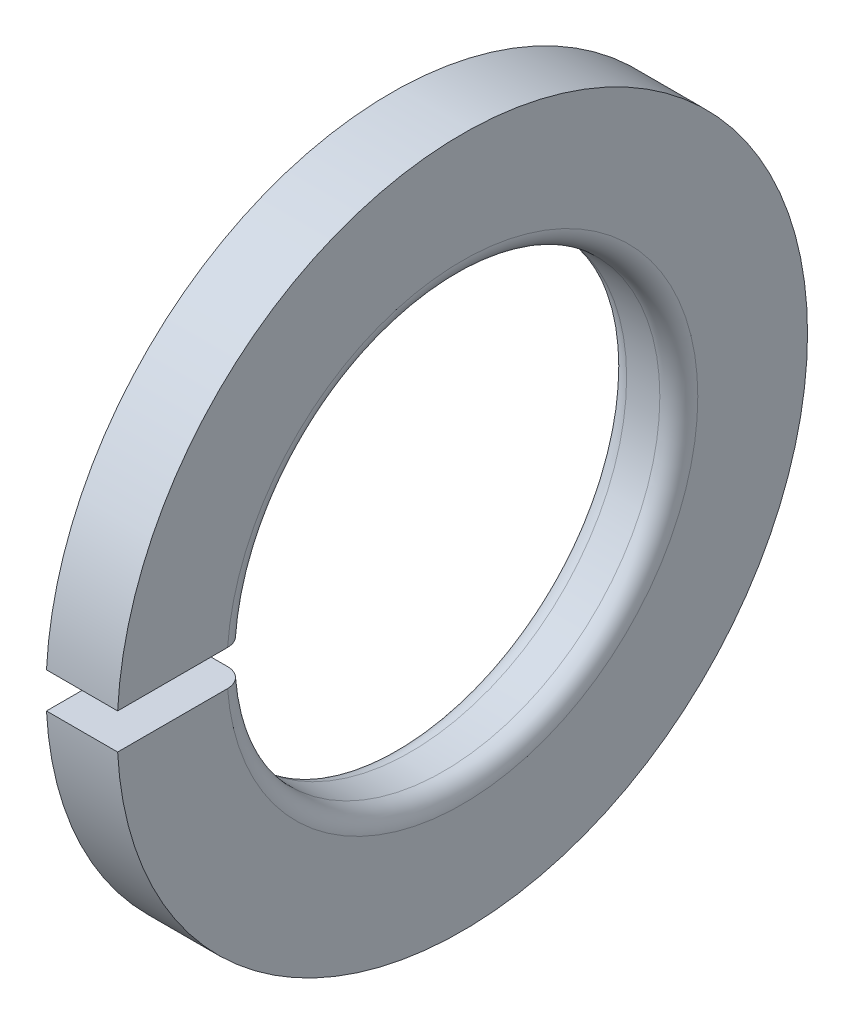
ISO-10303-21;
HEADER;
FILE_DESCRIPTION(('STEP AP214'),'2;1');
FILE_NAME('part.step','',(''),(''),'','','');
FILE_SCHEMA(('AUTOMOTIVE_DESIGN { 1 0 10303 214 1 1 1 1 }'));
ENDSEC;
DATA;
#1=APPLICATION_CONTEXT('core data for automotive mechanical design processes');
#2=APPLICATION_PROTOCOL_DEFINITION('international standard','automotive_design',2000,#1);
#3=PRODUCT_CONTEXT('',#1,'mechanical');
#4=PRODUCT('Part','Part','',(#3));
#5=PRODUCT_RELATED_PRODUCT_CATEGORY('part','',(#4));
#6=PRODUCT_DEFINITION_FORMATION('','',#4);
#7=PRODUCT_DEFINITION_CONTEXT('part definition',#1,'design');
#8=PRODUCT_DEFINITION('design','',#6,#7);
#9=PRODUCT_DEFINITION_SHAPE('','',#8);
#10=(LENGTH_UNIT() NAMED_UNIT(*) SI_UNIT(.MILLI.,.METRE.));
#11=(NAMED_UNIT(*) PLANE_ANGLE_UNIT() SI_UNIT($,.RADIAN.));
#12=(NAMED_UNIT(*) SI_UNIT($,.STERADIAN.) SOLID_ANGLE_UNIT());
#13=UNCERTAINTY_MEASURE_WITH_UNIT(LENGTH_MEASURE(1.E-05),#10,'distance_accuracy_value','');
#14=(GEOMETRIC_REPRESENTATION_CONTEXT(3) GLOBAL_UNCERTAINTY_ASSIGNED_CONTEXT((#13)) GLOBAL_UNIT_ASSIGNED_CONTEXT((#10,
#11,#12)) REPRESENTATION_CONTEXT('',''));
#15=CARTESIAN_POINT('',(0.,0.,0.));
#16=DIRECTION('',(0.,0.,1.));
#17=DIRECTION('',(1.,0.,0.));
#18=AXIS2_PLACEMENT_3D('',#15,#16,#17);
#19=CARTESIAN_POINT('',(-34.9249999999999,0.,0.));
#20=DIRECTION('',(-1.,0.,0.));
#21=DIRECTION('',(0.,0.,1.));
#22=AXIS2_PLACEMENT_3D('',#19,#20,#21);
#23=CYLINDRICAL_SURFACE('',#22,29.1);
#24=DIRECTION('',(-1.,0.,0.));
#25=VECTOR('',#24,1.);
#26=CARTESIAN_POINT('',(-34.9249999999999,1.5,29.0613144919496));
#27=LINE('',#26,#25);
#28=CARTESIAN_POINT('',(0.,1.5,29.0613144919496));
#29=VERTEX_POINT('',#28);
#30=CARTESIAN_POINT('',(-6.,1.5,29.0613144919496));
#31=VERTEX_POINT('',#30);
#32=EDGE_CURVE('E46',#29,#31,#27,.T.);
#33=ORIENTED_EDGE('',*,*,#32,.F.);
#34=CARTESIAN_POINT('',(0.,0.,0.));
#35=DIRECTION('',(-1.,0.,0.));
#36=DIRECTION('',(0.,0.,1.));
#37=AXIS2_PLACEMENT_3D('',#34,#35,#36);
#38=CIRCLE('',#37,29.1);
#39=CARTESIAN_POINT('',(0.,-1.5,29.0613144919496));
#40=VERTEX_POINT('',#39);
#41=EDGE_CURVE('E107',#29,#40,#38,.T.);
#42=ORIENTED_EDGE('',*,*,#41,.T.);
#43=DIRECTION('',(-1.,0.,0.));
#44=VECTOR('',#43,1.);
#45=CARTESIAN_POINT('',(-34.9249999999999,-1.5,29.0613144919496));
#46=LINE('',#45,#44);
#47=CARTESIAN_POINT('',(-6.,-1.5,29.0613144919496));
#48=VERTEX_POINT('',#47);
#49=EDGE_CURVE('E88',#48,#40,#46,.F.);
#50=ORIENTED_EDGE('',*,*,#49,.F.);
#51=CARTESIAN_POINT('',(-6.,0.,0.));
#52=DIRECTION('',(-1.,0.,0.));
#53=DIRECTION('',(0.,0.,1.));
#54=AXIS2_PLACEMENT_3D('',#51,#52,#53);
#55=CIRCLE('',#54,29.1);
#56=EDGE_CURVE('E119',#31,#48,#55,.T.);
#57=ORIENTED_EDGE('',*,*,#56,.F.);
#58=EDGE_LOOP('',(#33,#42,#50,#57));
#59=FACE_BOUND('',#58,.T.);
#60=ADVANCED_FACE('F33',(#59),#23,.T.);
#61=CARTESIAN_POINT('',(0.,19.85,0.));
#62=DIRECTION('',(-1.,0.,0.));
#63=DIRECTION('',(0.,0.,1.));
#64=AXIS2_PLACEMENT_3D('',#61,#62,#63);
#65=PLANE('',#64);
#66=DIRECTION('',(0.,0.,-1.));
#67=VECTOR('',#66,1.);
#68=CARTESIAN_POINT('',(0.,1.5,29.682));
#69=LINE('',#68,#67);
#70=CARTESIAN_POINT('',(0.,1.5,19.7932437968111));
#71=VERTEX_POINT('',#70);
#72=EDGE_CURVE('E93',#29,#71,#69,.T.);
#73=ORIENTED_EDGE('',*,*,#72,.T.);
#74=CARTESIAN_POINT('',(0.,0.,0.));
#75=DIRECTION('',(-1.,0.,0.));
#76=DIRECTION('',(0.,0.,1.));
#77=AXIS2_PLACEMENT_3D('',#74,#75,#76);
#78=CIRCLE('',#77,19.85);
#79=CARTESIAN_POINT('',(0.,-1.5,19.7932437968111));
#80=VERTEX_POINT('',#79);
#81=EDGE_CURVE('E100',#71,#80,#78,.T.);
#82=ORIENTED_EDGE('',*,*,#81,.T.);
#83=DIRECTION('',(0.,0.,1.));
#84=VECTOR('',#83,1.);
#85=CARTESIAN_POINT('',(0.,-1.5,0.));
#86=LINE('',#85,#84);
#87=EDGE_CURVE('E82',#80,#40,#86,.T.);
#88=ORIENTED_EDGE('',*,*,#87,.T.);
#89=ORIENTED_EDGE('',*,*,#41,.F.);
#90=EDGE_LOOP('',(#73,#82,#88,#89));
#91=FACE_BOUND('',#90,.T.);
#92=ADVANCED_FACE('F106',(#91),#65,.F.);
#93=CARTESIAN_POINT('',(-1.6,0.,0.));
#94=DIRECTION('',(-1.,0.,0.));
#95=DIRECTION('',(0.,0.,1.));
#96=AXIS2_PLACEMENT_3D('',#93,#94,#95);
#97=TOROIDAL_SURFACE('',#96,19.85,1.6);
#98=ORIENTED_EDGE('',*,*,#81,.F.);
#99=CARTESIAN_POINT('',(-1.25298037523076,1.5,18.2264660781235));
#100=CARTESIAN_POINT('',(-1.34042814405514,1.5,18.2069757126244));
#101=CARTESIAN_POINT('',(-1.42958478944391,1.5,18.1948546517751));
#102=CARTESIAN_POINT('',(-1.60874073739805,1.5,18.1857493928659));
#103=CARTESIAN_POINT('',(-1.69874091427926,1.5,18.1887831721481));
#104=CARTESIAN_POINT('',(-1.87691688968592,1.5,18.2099216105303));
#105=CARTESIAN_POINT('',(-1.96509356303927,1.5,18.2280188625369));
#106=CARTESIAN_POINT('',(-2.13713566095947,1.5,18.2787474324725));
#107=CARTESIAN_POINT('',(-2.22100211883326,1.5,18.3113752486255));
#108=CARTESIAN_POINT('',(-2.38213934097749,1.5,18.3902501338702));
#109=CARTESIAN_POINT('',(-2.45940535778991,1.5,18.4365069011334));
#110=CARTESIAN_POINT('',(-2.605104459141,1.5,18.5413052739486));
#111=CARTESIAN_POINT('',(-2.67353710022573,1.5,18.5998474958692));
#112=CARTESIAN_POINT('',(-2.7998187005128,1.5,18.727714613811));
#113=CARTESIAN_POINT('',(-2.85763944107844,1.5,18.7970673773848));
#114=CARTESIAN_POINT('',(-2.96086027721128,1.5,18.9444701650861));
#115=CARTESIAN_POINT('',(-3.0062601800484,1.5,19.0225203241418));
#116=CARTESIAN_POINT('',(-3.08349717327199,1.5,19.1853648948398));
#117=CARTESIAN_POINT('',(-3.11529145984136,1.5,19.270179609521));
#118=CARTESIAN_POINT('',(-3.16422330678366,1.5,19.4439365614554));
#119=CARTESIAN_POINT('',(-3.18136069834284,1.5,19.5328788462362));
#120=CARTESIAN_POINT('',(-3.2005191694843,1.5,19.7125655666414));
#121=CARTESIAN_POINT('',(-3.2025085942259,1.5,19.8033133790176));
#122=CARTESIAN_POINT('',(-3.19122833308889,1.5,19.9838562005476));
#123=CARTESIAN_POINT('',(-3.17795857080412,1.5,20.0736512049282));
#124=CARTESIAN_POINT('',(-3.13652216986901,1.5,20.2497586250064));
#125=CARTESIAN_POINT('',(-3.10835205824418,1.5,20.3360702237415));
#126=CARTESIAN_POINT('',(-3.03789973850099,1.5,20.5027282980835));
#127=CARTESIAN_POINT('',(-2.9956176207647,1.5,20.5830748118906));
#128=CARTESIAN_POINT('',(-2.89820398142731,1.5,20.7353886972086));
#129=CARTESIAN_POINT('',(-2.84309191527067,1.5,20.8073685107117));
#130=CARTESIAN_POINT('',(-2.72153836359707,1.5,20.9410252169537));
#131=CARTESIAN_POINT('',(-2.65509701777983,1.5,21.0027022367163));
#132=CARTESIAN_POINT('',(-2.51294485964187,1.5,21.1138406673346));
#133=CARTESIAN_POINT('',(-2.43725717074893,1.5,21.1633316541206));
#134=CARTESIAN_POINT('',(-2.27863173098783,1.5,21.2488689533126));
#135=CARTESIAN_POINT('',(-2.19569407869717,1.5,21.2849154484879));
#136=CARTESIAN_POINT('',(-2.02513478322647,1.5,21.3424543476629));
#137=CARTESIAN_POINT('',(-1.93752471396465,1.5,21.3639810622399));
#138=CARTESIAN_POINT('',(-1.7599325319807,1.5,21.391997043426));
#139=CARTESIAN_POINT('',(-1.6699504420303,1.5,21.3984864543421));
#140=CARTESIAN_POINT('',(-1.4903051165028,1.5,21.3962424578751));
#141=CARTESIAN_POINT('',(-1.40064160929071,1.5,21.3875307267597));
#142=CARTESIAN_POINT('',(-1.22405040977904,1.5,21.3551772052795));
#143=CARTESIAN_POINT('',(-1.13712271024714,1.5,21.3315354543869));
#144=CARTESIAN_POINT('',(-0.96846738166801,1.5,21.2700014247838));
#145=CARTESIAN_POINT('',(-0.886739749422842,1.5,21.2321091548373));
#146=CARTESIAN_POINT('',(-0.730793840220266,1.5,21.1431601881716));
#147=CARTESIAN_POINT('',(-0.656575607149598,1.5,21.0921034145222));
#148=CARTESIAN_POINT('',(-0.517638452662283,1.5,20.9782021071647));
#149=CARTESIAN_POINT('',(-0.452933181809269,1.5,20.915340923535));
#150=CARTESIAN_POINT('',(-0.334964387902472,1.5,20.77967039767));
#151=CARTESIAN_POINT('',(-0.281700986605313,1.5,20.7068609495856));
#152=CARTESIAN_POINT('',(-0.187992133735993,1.5,20.5531775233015));
#153=CARTESIAN_POINT('',(-0.147577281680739,1.5,20.4722848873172));
#154=CARTESIAN_POINT('',(-0.0808638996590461,1.5,20.3048742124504));
#155=CARTESIAN_POINT('',(-0.0545655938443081,1.5,20.2183560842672));
#156=CARTESIAN_POINT('',(-0.0167679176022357,1.5,20.0419232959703));
#157=CARTESIAN_POINT('',(-0.00530496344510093,1.5,19.9520008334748));
#158=CARTESIAN_POINT('',(0.00238683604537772,1.5,19.771506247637));
#159=CARTESIAN_POINT('',(-0.00138451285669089,1.5,19.6809341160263));
#160=CARTESIAN_POINT('',(-0.0240707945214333,1.5,19.5015639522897));
#161=CARTESIAN_POINT('',(-0.0430090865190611,1.5,19.4127688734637));
#162=CARTESIAN_POINT('',(-0.095526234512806,1.5,19.2396222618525));
#163=CARTESIAN_POINT('',(-0.129104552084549,1.5,19.1552705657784));
#164=CARTESIAN_POINT('',(-0.209946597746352,1.5,18.9934345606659));
#165=CARTESIAN_POINT('',(-0.25720606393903,1.5,18.9159481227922));
#166=CARTESIAN_POINT('',(-0.364102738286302,1.5,18.7700102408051));
#167=CARTESIAN_POINT('',(-0.423742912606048,1.5,18.7015609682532));
#168=CARTESIAN_POINT('',(-0.553593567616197,1.5,18.5757948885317));
#169=CARTESIAN_POINT('',(-0.623787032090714,1.5,18.5184604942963));
#170=CARTESIAN_POINT('',(-0.772776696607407,1.5,18.4164937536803));
#171=CARTESIAN_POINT('',(-0.851562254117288,1.5,18.371845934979));
#172=CARTESIAN_POINT('',(-0.984650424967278,1.5,18.3106507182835));
#173=CARTESIAN_POINT('',(-1.03704006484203,1.5,18.2898465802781));
#174=CARTESIAN_POINT('',(-1.14372153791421,1.5,18.2538797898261));
#175=CARTESIAN_POINT('',(-1.19801336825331,1.5,18.2387171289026));
#176=CARTESIAN_POINT('',(-1.25298037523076,1.5,18.2264660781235));
#177=B_SPLINE_CURVE_WITH_KNOTS('',3,(#99,#100,#101,#102,#103,#104,#105,#106,#107,#108,#109,#110,
#111,#112,#113,#114,#115,#116,#117,#118,#119,#120,#121,#122,#123,#124,#125,#126,#127,#128,#129,
#130,#131,#132,#133,#134,#135,#136,#137,#138,#139,#140,#141,#142,#143,#144,#145,#146,#147,#148,
#149,#150,#151,#152,#153,#154,#155,#156,#157,#158,#159,#160,#161,#162,#163,#164,#165,#166,#167,
#168,#169,#170,#171,#172,#173,#174,#175,#176),.UNSPECIFIED.,.T.,.F.,(4,2,2,2,2,2,2,2,2,2,2,2,2,
2,2,2,2,2,2,2,2,2,2,2,2,2,2,2,2,2,2,2,2,2,2,2,2,2,4),(0.,0.268574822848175,0.537468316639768,
0.806229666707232,1.07492628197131,1.34381456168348,1.61271633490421,1.88232311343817,
2.15193407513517,2.42238711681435,2.69284327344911,2.96386445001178,3.23488698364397,
3.50597271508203,3.77705671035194,4.04773227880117,4.31840450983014,4.58841318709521,
4.85841819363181,5.12778291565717,5.39714505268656,5.6661234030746,5.93510104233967,
6.20407851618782,6.47305756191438,6.74241888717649,7.01178307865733,7.28178405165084,
7.55178931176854,7.8224561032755,8.09312634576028,8.36421426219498,8.63529220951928,
8.90628580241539,9.17734439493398,9.4479705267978,9.71826517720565,9.88708339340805,
10.0559013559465),.UNSPECIFIED.);
#178=CARTESIAN_POINT('',(-1.60000000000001,1.5,18.1882517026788));
#179=VERTEX_POINT('',#178);
#180=EDGE_CURVE('E126',#71,#179,#177,.T.);
#181=ORIENTED_EDGE('',*,*,#180,.T.);
#182=CARTESIAN_POINT('',(-1.60000000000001,0.,0.));
#183=DIRECTION('',(-1.,0.,0.));
#184=DIRECTION('',(0.,0.,1.));
#185=AXIS2_PLACEMENT_3D('',#182,#183,#184);
#186=CIRCLE('',#185,18.25);
#187=CARTESIAN_POINT('',(-1.60000000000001,-1.5,18.1882517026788));
#188=VERTEX_POINT('',#187);
#189=EDGE_CURVE('E102',#179,#188,#186,.T.);
#190=ORIENTED_EDGE('',*,*,#189,.T.);
#191=CARTESIAN_POINT('',(-1.25298037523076,-1.5,18.2264660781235));
#192=CARTESIAN_POINT('',(-1.16534855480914,-1.5,18.2460057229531));
#193=CARTESIAN_POINT('',(-1.07930546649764,-1.5,18.2729745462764));
#194=CARTESIAN_POINT('',(-0.912903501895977,-1.5,18.3410113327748));
#195=CARTESIAN_POINT('',(-0.832551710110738,-1.5,18.3820965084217));
#196=CARTESIAN_POINT('',(-0.679924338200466,-1.5,18.4771473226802));
#197=CARTESIAN_POINT('',(-0.60764396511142,-1.5,18.5311052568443));
#198=CARTESIAN_POINT('',(-0.473163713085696,-1.5,18.65035078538));
#199=CARTESIAN_POINT('',(-0.410961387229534,-1.5,18.7156356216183));
#200=CARTESIAN_POINT('',(-0.29822041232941,-1.5,18.8558467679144));
#201=CARTESIAN_POINT('',(-0.247708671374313,-1.5,18.9307947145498));
#202=CARTESIAN_POINT('',(-0.159939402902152,-1.5,19.0880901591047));
#203=CARTESIAN_POINT('',(-0.122682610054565,-1.5,19.1704380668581));
#204=CARTESIAN_POINT('',(-0.0623741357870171,-1.5,19.3404534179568));
#205=CARTESIAN_POINT('',(-0.0393644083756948,-1.5,19.4281357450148));
#206=CARTESIAN_POINT('',(-0.00836619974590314,-1.5,19.6061167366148));
#207=CARTESIAN_POINT('',(-0.000377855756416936,-1.5,19.696415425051));
#208=CARTESIAN_POINT('',(0.000352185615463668,-1.5,19.8772171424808));
#209=CARTESIAN_POINT('',(-0.00693009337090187,-1.5,19.9677202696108));
#210=CARTESIAN_POINT('',(-0.0365903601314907,-1.5,20.1462185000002));
#211=CARTESIAN_POINT('',(-0.0589683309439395,-1.5,20.2342136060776));
#212=CARTESIAN_POINT('',(-0.11818624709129,-1.5,20.4051618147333));
#213=CARTESIAN_POINT('',(-0.155021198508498,-1.5,20.4881166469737));
#214=CARTESIAN_POINT('',(-0.242120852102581,-1.5,20.6466485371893));
#215=CARTESIAN_POINT('',(-0.292385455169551,-1.5,20.7222256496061));
#216=CARTESIAN_POINT('',(-0.404819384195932,-1.5,20.8637001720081));
#217=CARTESIAN_POINT('',(-0.466965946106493,-1.5,20.9296156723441));
#218=CARTESIAN_POINT('',(-0.601468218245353,-1.5,21.0500449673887));
#219=CARTESIAN_POINT('',(-0.673823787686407,-1.5,21.1045589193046));
#220=CARTESIAN_POINT('',(-0.826493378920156,-1.5,21.2004914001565));
#221=CARTESIAN_POINT('',(-0.906786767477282,-1.5,21.2419427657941));
#222=CARTESIAN_POINT('',(-1.0732037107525,-1.5,21.3107434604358));
#223=CARTESIAN_POINT('',(-1.15932719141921,-1.5,21.3380929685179));
#224=CARTESIAN_POINT('',(-1.33475936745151,-1.5,21.3778570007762));
#225=CARTESIAN_POINT('',(-1.4240607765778,-1.5,21.3903036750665));
#226=CARTESIAN_POINT('',(-1.60348491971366,-1.5,21.4000109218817));
#227=CARTESIAN_POINT('',(-1.69360764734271,-1.5,21.3972716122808));
#228=CARTESIAN_POINT('',(-1.87201905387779,-1.5,21.3766967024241));
#229=CARTESIAN_POINT('',(-1.96030951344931,-1.5,21.3588765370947));
#230=CARTESIAN_POINT('',(-2.13264747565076,-1.5,21.3086728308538));
#231=CARTESIAN_POINT('',(-2.21669497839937,-1.5,21.2762892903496));
#232=CARTESIAN_POINT('',(-2.37820588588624,-1.5,21.1978699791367));
#233=CARTESIAN_POINT('',(-2.45566628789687,-1.5,21.1518280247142));
#234=CARTESIAN_POINT('',(-2.60177564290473,-1.5,21.0474148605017));
#235=CARTESIAN_POINT('',(-2.67042452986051,-1.5,20.9890435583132));
#236=CARTESIAN_POINT('',(-2.79709621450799,-1.5,20.8615213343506));
#237=CARTESIAN_POINT('',(-2.85509990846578,-1.5,20.7923514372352));
#238=CARTESIAN_POINT('',(-2.95870573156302,-1.5,20.6452759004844));
#239=CARTESIAN_POINT('',(-3.00430769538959,-1.5,20.567370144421));
#240=CARTESIAN_POINT('',(-3.08193659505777,-1.5,20.404826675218));
#241=CARTESIAN_POINT('',(-3.113929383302,-1.5,20.3201726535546));
#242=CARTESIAN_POINT('',(-3.16328501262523,-1.5,20.1467022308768));
#243=CARTESIAN_POINT('',(-3.18064766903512,-1.5,20.0578857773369));
#244=CARTESIAN_POINT('',(-3.20028572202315,-1.5,19.8783951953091));
#245=CARTESIAN_POINT('',(-3.20252668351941,-1.5,19.7877172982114));
#246=CARTESIAN_POINT('',(-3.19177100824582,-1.5,19.6072691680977));
#247=CARTESIAN_POINT('',(-3.17877420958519,-1.5,19.5174989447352));
#248=CARTESIAN_POINT('',(-3.13788622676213,-1.5,19.3413158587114));
#249=CARTESIAN_POINT('',(-3.10997925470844,-1.5,19.2549066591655));
#250=CARTESIAN_POINT('',(-3.04004343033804,-1.5,19.0880047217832));
#251=CARTESIAN_POINT('',(-2.99801456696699,-1.5,19.0075119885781));
#252=CARTESIAN_POINT('',(-2.90105362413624,-1.5,18.854801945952));
#253=CARTESIAN_POINT('',(-2.8461316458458,-1.5,18.7825782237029));
#254=CARTESIAN_POINT('',(-2.7249157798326,-1.5,18.6484085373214));
#255=CARTESIAN_POINT('',(-2.65862247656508,-1.5,18.586462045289));
#256=CARTESIAN_POINT('',(-2.51672811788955,-1.5,18.474779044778));
#257=CARTESIAN_POINT('',(-2.44115198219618,-1.5,18.4250108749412));
#258=CARTESIAN_POINT('',(-2.28267459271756,-1.5,18.3389039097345));
#259=CARTESIAN_POINT('',(-2.19977164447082,-1.5,18.3025682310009));
#260=CARTESIAN_POINT('',(-2.02926265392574,-1.5,18.2444784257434));
#261=CARTESIAN_POINT('',(-1.94166980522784,-1.5,18.2226854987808));
#262=CARTESIAN_POINT('',(-1.76413858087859,-1.5,18.1941825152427));
#263=CARTESIAN_POINT('',(-1.67420321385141,-1.5,18.1874539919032));
#264=CARTESIAN_POINT('',(-1.52868981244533,-1.5,18.1888702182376));
#265=CARTESIAN_POINT('',(-1.47302530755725,-1.5,18.1923397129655));
#266=CARTESIAN_POINT('',(-1.3623633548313,-1.5,18.205074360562));
#267=CARTESIAN_POINT('',(-1.30736590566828,-1.5,18.2143395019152));
#268=CARTESIAN_POINT('',(-1.25298037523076,-1.5,18.2264660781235));
#269=B_SPLINE_CURVE_WITH_KNOTS('',3,(#191,#192,#193,#194,#195,#196,#197,#198,#199,#200,#201,
#202,#203,#204,#205,#206,#207,#208,#209,#210,#211,#212,#213,#214,#215,#216,#217,#218,#219,#220,
#221,#222,#223,#224,#225,#226,#227,#228,#229,#230,#231,#232,#233,#234,#235,#236,#237,#238,#239,
#240,#241,#242,#243,#244,#245,#246,#247,#248,#249,#250,#251,#252,#253,#254,#255,#256,#257,#258,
#259,#260,#261,#262,#263,#264,#265,#266,#267,#268),.UNSPECIFIED.,.T.,.F.,(4,2,2,2,2,2,2,2,2,2,2,
2,2,2,2,2,2,2,2,2,2,2,2,2,2,2,2,2,2,2,2,2,2,2,2,2,2,2,4),(0.,0.269147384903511,
0.538624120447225,0.807939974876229,1.07719034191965,1.34705440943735,1.61693343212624,
1.88760344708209,2.1582759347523,2.42937372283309,2.70047120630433,2.97147512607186,
3.24247704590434,3.51296487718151,3.78344897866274,4.05324761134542,4.32304281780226,
4.59225493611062,4.86146496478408,5.13039979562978,5.39933461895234,5.66839138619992,
5.93745016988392,6.20698717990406,6.47652778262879,6.74674077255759,7.01695717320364,
7.28778870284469,7.55862310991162,7.829744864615,8.10086683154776,8.37177709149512,
8.64267343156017,8.91285782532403,9.18310486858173,9.45262797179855,9.72182049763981,
9.88885745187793,10.0558940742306),.UNSPECIFIED.);
#270=EDGE_CURVE('E85',#188,#80,#269,.T.);
#271=ORIENTED_EDGE('',*,*,#270,.T.);
#272=EDGE_LOOP('',(#98,#181,#190,#271));
#273=FACE_BOUND('',#272,.T.);
#274=ADVANCED_FACE('F98',(#273),#97,.T.);
#275=CARTESIAN_POINT('',(-34.9249999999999,0.,0.));
#276=DIRECTION('',(-1.,0.,0.));
#277=DIRECTION('',(0.,0.,1.));
#278=AXIS2_PLACEMENT_3D('',#275,#276,#277);
#279=CYLINDRICAL_SURFACE('',#278,18.25);
#280=DIRECTION('',(-1.,0.,0.));
#281=VECTOR('',#280,1.);
#282=CARTESIAN_POINT('',(-34.9249999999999,1.5,18.1882517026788));
#283=LINE('',#282,#281);
#284=CARTESIAN_POINT('',(-4.39999999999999,1.5,18.1882517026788));
#285=VERTEX_POINT('',#284);
#286=EDGE_CURVE('E134',#285,#179,#283,.F.);
#287=ORIENTED_EDGE('',*,*,#286,.F.);
#288=CARTESIAN_POINT('',(-4.39999999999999,0.,0.));
#289=DIRECTION('',(-1.,0.,0.));
#290=DIRECTION('',(0.,0.,1.));
#291=AXIS2_PLACEMENT_3D('',#288,#289,#290);
#292=CIRCLE('',#291,18.25);
#293=CARTESIAN_POINT('',(-4.3999999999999,-1.5,18.1882517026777));
#294=VERTEX_POINT('',#293);
#295=EDGE_CURVE('E110',#285,#294,#292,.T.);
#296=ORIENTED_EDGE('',*,*,#295,.T.);
#297=DIRECTION('',(-1.,0.,0.));
#298=VECTOR('',#297,1.);
#299=CARTESIAN_POINT('',(-34.9249999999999,-1.5,18.1882517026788));
#300=LINE('',#299,#298);
#301=EDGE_CURVE('E103',#188,#294,#300,.T.);
#302=ORIENTED_EDGE('',*,*,#301,.F.);
#303=ORIENTED_EDGE('',*,*,#189,.F.);
#304=EDGE_LOOP('',(#287,#296,#302,#303));
#305=FACE_BOUND('',#304,.T.);
#306=ADVANCED_FACE('F133',(#305),#279,.F.);
#307=CARTESIAN_POINT('',(-4.4,0.,0.));
#308=DIRECTION('',(-1.,0.,0.));
#309=DIRECTION('',(0.,0.,1.));
#310=AXIS2_PLACEMENT_3D('',#307,#308,#309);
#311=TOROIDAL_SURFACE('',#310,19.85,1.6);
#312=ORIENTED_EDGE('',*,*,#295,.F.);
#313=CARTESIAN_POINT('',(-5.28660230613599,1.5,18.4572566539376));
#314=CARTESIAN_POINT('',(-5.36150990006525,1.5,18.5072897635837));
#315=CARTESIAN_POINT('',(-5.43223754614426,1.5,18.5637014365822));
#316=CARTESIAN_POINT('',(-5.56326738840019,1.5,18.687655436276));
#317=CARTESIAN_POINT('',(-5.62355652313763,1.5,18.7552115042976));
#318=CARTESIAN_POINT('',(-5.73191381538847,1.5,18.8994456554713));
#319=CARTESIAN_POINT('',(-5.779989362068,1.5,18.9761181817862));
#320=CARTESIAN_POINT('',(-5.86260283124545,1.5,19.136411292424));
#321=CARTESIAN_POINT('',(-5.89714412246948,1.5,19.2200301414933));
#322=CARTESIAN_POINT('',(-5.95180641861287,1.5,19.3920559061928));
#323=CARTESIAN_POINT('',(-5.97189599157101,1.5,19.4804728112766));
#324=CARTESIAN_POINT('',(-5.99696992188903,1.5,19.6594270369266));
#325=CARTESIAN_POINT('',(-6.00195352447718,1.5,19.7499644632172));
#326=CARTESIAN_POINT('',(-5.99666772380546,1.5,19.9307179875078));
#327=CARTESIAN_POINT('',(-5.98637740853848,1.5,20.0209334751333));
#328=CARTESIAN_POINT('',(-5.95078922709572,1.5,20.198354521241));
#329=CARTESIAN_POINT('',(-5.92549139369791,1.5,20.2855600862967));
#330=CARTESIAN_POINT('',(-5.86061125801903,1.5,20.4544330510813));
#331=CARTESIAN_POINT('',(-5.82103646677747,1.5,20.5361033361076));
#332=CARTESIAN_POINT('',(-5.72871090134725,1.5,20.6916222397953));
#333=CARTESIAN_POINT('',(-5.67596027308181,1.5,20.7654709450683));
#334=CARTESIAN_POINT('',(-5.55889027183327,1.5,20.9030894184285));
#335=CARTESIAN_POINT('',(-5.49459430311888,1.5,20.9668790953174));
#336=CARTESIAN_POINT('',(-5.35618157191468,1.5,21.0827252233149));
#337=CARTESIAN_POINT('',(-5.28206493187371,1.5,21.1347818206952));
#338=CARTESIAN_POINT('',(-5.12631716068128,1.5,21.2255445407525));
#339=CARTESIAN_POINT('',(-5.04470560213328,1.5,21.2642842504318));
#340=CARTESIAN_POINT('',(-4.87612784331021,1.5,21.3274797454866));
#341=CARTESIAN_POINT('',(-4.78916171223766,1.5,21.3519357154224));
#342=CARTESIAN_POINT('',(-4.6125375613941,1.5,21.3858222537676));
#343=CARTESIAN_POINT('',(-4.52288550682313,1.5,21.3952839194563));
#344=CARTESIAN_POINT('',(-4.34326662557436,1.5,21.3990069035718));
#345=CARTESIAN_POINT('',(-4.25329980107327,1.5,21.3932683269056));
#346=CARTESIAN_POINT('',(-4.07568855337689,1.5,21.3667682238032));
#347=CARTESIAN_POINT('',(-3.98804214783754,1.5,21.346019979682));
#348=CARTESIAN_POINT('',(-3.81747362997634,1.5,21.2901118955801));
#349=CARTESIAN_POINT('',(-3.73455152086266,1.5,21.254952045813));
#350=CARTESIAN_POINT('',(-3.57572831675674,1.5,21.1712035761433));
#351=CARTESIAN_POINT('',(-3.49983145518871,1.5,21.1226069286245));
#352=CARTESIAN_POINT('',(-3.35725400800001,1.5,21.0133837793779));
#353=CARTESIAN_POINT('',(-3.29057349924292,1.5,20.9527571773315));
#354=CARTESIAN_POINT('',(-3.16818407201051,1.5,20.821076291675));
#355=CARTESIAN_POINT('',(-3.11249603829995,1.5,20.7500025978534));
#356=CARTESIAN_POINT('',(-3.01380726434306,1.5,20.5995343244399));
#357=CARTESIAN_POINT('',(-2.97080669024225,1.5,20.5201396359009));
#358=CARTESIAN_POINT('',(-2.89859885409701,1.5,20.3550692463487));
#359=CARTESIAN_POINT('',(-2.86942659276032,1.5,20.269378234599));
#360=CARTESIAN_POINT('',(-2.82584698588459,1.5,20.0943205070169));
#361=CARTESIAN_POINT('',(-2.81143984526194,1.5,20.0049537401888));
#362=CARTESIAN_POINT('',(-2.79777293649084,1.5,19.8248711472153));
#363=CARTESIAN_POINT('',(-2.79854655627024,1.5,19.7341527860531));
#364=CARTESIAN_POINT('',(-2.81529810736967,1.5,19.5541305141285));
#365=CARTESIAN_POINT('',(-2.8312761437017,1.5,19.4648266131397));
#366=CARTESIAN_POINT('',(-2.87800936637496,1.5,19.2900859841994));
#367=CARTESIAN_POINT('',(-2.90877780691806,1.5,19.2046528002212));
#368=CARTESIAN_POINT('',(-2.98423465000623,1.5,19.040171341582));
#369=CARTESIAN_POINT('',(-3.02892304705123,1.5,18.9611230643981));
#370=CARTESIAN_POINT('',(-3.13091276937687,1.5,18.8117460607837));
#371=CARTESIAN_POINT('',(-3.18820152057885,1.5,18.7414087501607));
#372=CARTESIAN_POINT('',(-3.31380312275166,1.5,18.6113819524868));
#373=CARTESIAN_POINT('',(-3.38211585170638,1.5,18.5516923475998));
#374=CARTESIAN_POINT('',(-3.52763674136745,1.5,18.4448272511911));
#375=CARTESIAN_POINT('',(-3.60482104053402,1.5,18.3976192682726));
#376=CARTESIAN_POINT('',(-3.76603586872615,1.5,18.3168808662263));
#377=CARTESIAN_POINT('',(-3.85006600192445,1.5,18.2833496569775));
#378=CARTESIAN_POINT('',(-4.02229700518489,1.5,18.2310232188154));
#379=CARTESIAN_POINT('',(-4.11048347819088,1.5,18.2121805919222));
#380=CARTESIAN_POINT('',(-4.28879364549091,1.5,18.1895978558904));
#381=CARTESIAN_POINT('',(-4.37891779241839,1.5,18.1858613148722));
#382=CARTESIAN_POINT('',(-4.55836298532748,1.5,18.1935981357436));
#383=CARTESIAN_POINT('',(-4.64768505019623,1.5,18.2050482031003));
#384=CARTESIAN_POINT('',(-4.82306060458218,1.5,18.2427824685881));
#385=CARTESIAN_POINT('',(-4.90911792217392,1.5,18.2690486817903));
#386=CARTESIAN_POINT('',(-5.0438884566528,1.5,18.3229283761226));
#387=CARTESIAN_POINT('',(-5.09436647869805,1.5,18.3462376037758));
#388=CARTESIAN_POINT('',(-5.19262694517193,1.5,18.3979749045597));
#389=CARTESIAN_POINT('',(-5.24040939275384,1.5,18.4264029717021));
#390=CARTESIAN_POINT('',(-5.28660230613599,1.5,18.4572566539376));
#391=B_SPLINE_CURVE_WITH_KNOTS('',3,(#313,#314,#315,#316,#317,#318,#319,#320,#321,#322,#323,
#324,#325,#326,#327,#328,#329,#330,#331,#332,#333,#334,#335,#336,#337,#338,#339,#340,#341,#342,
#343,#344,#345,#346,#347,#348,#349,#350,#351,#352,#353,#354,#355,#356,#357,#358,#359,#360,#361,
#362,#363,#364,#365,#366,#367,#368,#369,#370,#371,#372,#373,#374,#375,#376,#377,#378,#379,#380,
#381,#382,#383,#384,#385,#386,#387,#388,#389,#390),.UNSPECIFIED.,.T.,.F.,(4,2,2,2,2,2,2,2,2,2,2,
2,2,2,2,2,2,2,2,2,2,2,2,2,2,2,2,2,2,2,2,2,2,2,2,2,2,2,4),(0.,0.270037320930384,
0.540410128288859,0.810618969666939,1.08076051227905,1.35148784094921,1.62222869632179,
1.89334057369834,2.16445185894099,2.4354207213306,2.70638658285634,2.97680922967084,
3.24722850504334,3.51696065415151,3.78668931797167,4.05585784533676,4.3250245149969,
4.59395328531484,4.86288223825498,5.13197220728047,5.40106442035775,5.67066306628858,
5.9402652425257,6.21054620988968,6.48083092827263,6.75171016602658,7.02259127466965,
7.29371558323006,7.56483978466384,7.83569464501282,8.10654650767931,8.37668620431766,
8.64681029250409,8.91605907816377,9.18537145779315,9.45427122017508,9.72284527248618,
9.88936811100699,10.0558907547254),.UNSPECIFIED.);
#392=CARTESIAN_POINT('',(-6.,1.5,19.7932437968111));
#393=VERTEX_POINT('',#392);
#394=EDGE_CURVE('E120',#285,#393,#391,.T.);
#395=ORIENTED_EDGE('',*,*,#394,.T.);
#396=CARTESIAN_POINT('',(-6.,0.,0.));
#397=DIRECTION('',(-1.,0.,0.));
#398=DIRECTION('',(0.,0.,1.));
#399=AXIS2_PLACEMENT_3D('',#396,#397,#398);
#400=CIRCLE('',#399,19.85);
#401=CARTESIAN_POINT('',(-6.,-1.5,19.7932437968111));
#402=VERTEX_POINT('',#401);
#403=EDGE_CURVE('E123',#393,#402,#400,.T.);
#404=ORIENTED_EDGE('',*,*,#403,.T.);
#405=CARTESIAN_POINT('',(-5.28660230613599,-1.5,18.4572566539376));
#406=CARTESIAN_POINT('',(-5.21201620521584,-1.5,18.4074478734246));
#407=CARTESIAN_POINT('',(-5.13317861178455,-1.5,18.3638899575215));
#408=CARTESIAN_POINT('',(-4.96924650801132,-1.5,18.290587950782));
#409=CARTESIAN_POINT('',(-4.88414480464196,-1.5,18.2608600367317));
#410=CARTESIAN_POINT('',(-4.71018066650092,-1.5,18.2161361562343));
#411=CARTESIAN_POINT('',(-4.62131970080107,-1.5,18.2011344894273));
#412=CARTESIAN_POINT('',(-4.44236413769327,-1.5,18.1862882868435));
#413=CARTESIAN_POINT('',(-4.35226984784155,-1.5,18.186440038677));
#414=CARTESIAN_POINT('',(-4.17348821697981,-1.5,18.2018763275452));
#415=CARTESIAN_POINT('',(-4.08479942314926,-1.5,18.2171440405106));
#416=CARTESIAN_POINT('',(-3.91123886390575,-1.5,18.2623457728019));
#417=CARTESIAN_POINT('',(-3.82636724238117,-1.5,18.2922803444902));
#418=CARTESIAN_POINT('',(-3.66280199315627,-1.5,18.3659700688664));
#419=CARTESIAN_POINT('',(-3.58411149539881,-1.5,18.4097321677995));
#420=CARTESIAN_POINT('',(-3.43517013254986,-1.5,18.5098146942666));
#421=CARTESIAN_POINT('',(-3.36491935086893,-1.5,18.5661352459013));
#422=CARTESIAN_POINT('',(-3.23465902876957,-1.5,18.6898832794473));
#423=CARTESIAN_POINT('',(-3.17467566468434,-1.5,18.7573383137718));
#424=CARTESIAN_POINT('',(-3.06684224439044,-1.5,18.9013340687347));
#425=CARTESIAN_POINT('',(-3.0189923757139,-1.5,18.9778749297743));
#426=CARTESIAN_POINT('',(-2.93662744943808,-1.5,19.1381288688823));
#427=CARTESIAN_POINT('',(-2.90215482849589,-1.5,19.2218637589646));
#428=CARTESIAN_POINT('',(-2.84772088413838,-1.5,19.3939246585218));
#429=CARTESIAN_POINT('',(-2.82775977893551,-1.5,19.4822507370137));
#430=CARTESIAN_POINT('',(-2.802878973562,-1.5,19.6611987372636));
#431=CARTESIAN_POINT('',(-2.7979930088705,-1.5,19.7518253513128));
#432=CARTESIAN_POINT('',(-2.80349794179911,-1.5,19.9326138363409));
#433=CARTESIAN_POINT('',(-2.81388890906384,-1.5,20.0227757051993));
#434=CARTESIAN_POINT('',(-2.84966881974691,-1.5,20.2001128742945));
#435=CARTESIAN_POINT('',(-2.87506403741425,-1.5,20.2872869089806));
#436=CARTESIAN_POINT('',(-2.94014904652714,-1.5,20.4561252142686));
#437=CARTESIAN_POINT('',(-2.97983876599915,-1.5,20.5377895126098));
#438=CARTESIAN_POINT('',(-3.07233430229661,-1.5,20.6931666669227));
#439=CARTESIAN_POINT('',(-3.12512209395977,-1.5,20.7668902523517));
#440=CARTESIAN_POINT('',(-3.24235320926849,-1.5,20.9044014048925));
#441=CARTESIAN_POINT('',(-3.30679639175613,-1.5,20.96818909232));
#442=CARTESIAN_POINT('',(-3.44534384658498,-1.5,21.0838529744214));
#443=CARTESIAN_POINT('',(-3.51942450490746,-1.5,21.1357574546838));
#444=CARTESIAN_POINT('',(-3.67526537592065,-1.5,21.2263571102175));
#445=CARTESIAN_POINT('',(-3.75702548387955,-1.5,21.2650524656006));
#446=CARTESIAN_POINT('',(-3.92569124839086,-1.5,21.3280400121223));
#447=CARTESIAN_POINT('',(-4.01258396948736,-1.5,21.3523668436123));
#448=CARTESIAN_POINT('',(-4.18922269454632,-1.5,21.3860619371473));
#449=CARTESIAN_POINT('',(-4.2789686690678,-1.5,21.3954303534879));
#450=CARTESIAN_POINT('',(-4.4586185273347,-1.5,21.3989357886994));
#451=CARTESIAN_POINT('',(-4.54852195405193,-1.5,21.3930962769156));
#452=CARTESIAN_POINT('',(-4.72607134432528,-1.5,21.3664038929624));
#453=CARTESIAN_POINT('',(-4.8137173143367,-1.5,21.345551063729));
#454=CARTESIAN_POINT('',(-4.98425354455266,-1.5,21.2894357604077));
#455=CARTESIAN_POINT('',(-5.06714448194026,-1.5,21.2541753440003));
#456=CARTESIAN_POINT('',(-5.22584055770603,-1.5,21.1702562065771));
#457=CARTESIAN_POINT('',(-5.30164567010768,-1.5,21.1215974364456));
#458=CARTESIAN_POINT('',(-5.44412785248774,-1.5,21.0122005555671));
#459=CARTESIAN_POINT('',(-5.51079293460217,-1.5,20.9514468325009));
#460=CARTESIAN_POINT('',(-5.63300602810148,-1.5,20.8196324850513));
#461=CARTESIAN_POINT('',(-5.68855389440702,-1.5,20.7485717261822));
#462=CARTESIAN_POINT('',(-5.78709400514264,-1.5,20.5979866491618));
#463=CARTESIAN_POINT('',(-5.83005701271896,-1.5,20.5184431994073));
#464=CARTESIAN_POINT('',(-5.90205712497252,-1.5,20.3532853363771));
#465=CARTESIAN_POINT('',(-5.93109400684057,-1.5,20.2676708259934));
#466=CARTESIAN_POINT('',(-5.97449085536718,-1.5,20.0925714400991));
#467=CARTESIAN_POINT('',(-5.9888138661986,-1.5,20.0030774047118));
#468=CARTESIAN_POINT('',(-6.00225846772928,-1.5,19.8229578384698));
#469=CARTESIAN_POINT('',(-6.00138047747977,-1.5,19.7323323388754));
#470=CARTESIAN_POINT('',(-5.98443963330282,-1.5,19.5523701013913));
#471=CARTESIAN_POINT('',(-5.96835325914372,-1.5,19.4630355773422));
#472=CARTESIAN_POINT('',(-5.9214051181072,-1.5,19.2883105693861));
#473=CARTESIAN_POINT('',(-5.89053964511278,-1.5,19.2029210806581));
#474=CARTESIAN_POINT('',(-5.81488897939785,-1.5,19.0385101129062));
#475=CARTESIAN_POINT('',(-5.77009747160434,-1.5,18.9594915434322));
#476=CARTESIAN_POINT('',(-5.667886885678,-1.5,18.8101888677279));
#477=CARTESIAN_POINT('',(-5.61048313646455,-1.5,18.7398943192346));
#478=CARTESIAN_POINT('',(-5.5081300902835,-1.5,18.634186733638));
#479=CARTESIAN_POINT('',(-5.46648351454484,-1.5,18.5955208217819));
#480=CARTESIAN_POINT('',(-5.37932659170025,-1.5,18.5228205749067));
#481=CARTESIAN_POINT('',(-5.33381624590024,-1.5,18.4887862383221));
#482=CARTESIAN_POINT('',(-5.28660230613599,-1.5,18.4572566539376));
#483=B_SPLINE_CURVE_WITH_KNOTS('',3,(#405,#406,#407,#408,#409,#410,#411,#412,#413,#414,#415,
#416,#417,#418,#419,#420,#421,#422,#423,#424,#425,#426,#427,#428,#429,#430,#431,#432,#433,#434,
#435,#436,#437,#438,#439,#440,#441,#442,#443,#444,#445,#446,#447,#448,#449,#450,#451,#452,#453,
#454,#455,#456,#457,#458,#459,#460,#461,#462,#463,#464,#465,#466,#467,#468,#469,#470,#471,#472,
#473,#474,#475,#476,#477,#478,#479,#480,#481,#482),.UNSPECIFIED.,.T.,.F.,(4,2,2,2,2,2,2,2,2,2,2,
2,2,2,2,2,2,2,2,2,2,2,2,2,2,2,2,2,2,2,2,2,2,2,2,2,2,2,4),(0.,0.268858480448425,
0.538030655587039,0.807098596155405,1.07610061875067,1.34480357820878,1.61351665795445,
1.88236494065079,2.15121588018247,2.42074235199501,2.69027298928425,2.96065180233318,
3.23103468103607,3.50202219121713,3.77301093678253,4.04411308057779,4.31521385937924,
4.58594360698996,4.85667007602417,5.1267452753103,5.39681679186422,5.66623452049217,
5.93564947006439,6.20464889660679,6.47364755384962,6.74260780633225,7.01156904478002,
7.28087973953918,7.55019394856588,7.8201289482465,8.09006826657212,8.36068392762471,
8.63129212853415,8.90231951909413,9.17341491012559,9.44463341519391,9.71552408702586,
9.88571494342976,10.0559057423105),.UNSPECIFIED.);
#484=EDGE_CURVE('E54',#402,#294,#483,.T.);
#485=ORIENTED_EDGE('',*,*,#484,.T.);
#486=EDGE_LOOP('',(#312,#395,#404,#485));
#487=FACE_BOUND('',#486,.T.);
#488=ADVANCED_FACE('F137',(#487),#311,.T.);
#489=CARTESIAN_POINT('',(-6.,29.1,0.));
#490=DIRECTION('',(1.,0.,0.));
#491=DIRECTION('',(0.,0.,-1.));
#492=AXIS2_PLACEMENT_3D('',#489,#490,#491);
#493=PLANE('',#492);
#494=DIRECTION('',(0.,0.,-1.));
#495=VECTOR('',#494,1.);
#496=CARTESIAN_POINT('',(-6.,1.5,0.));
#497=LINE('',#496,#495);
#498=EDGE_CURVE('E11',#31,#393,#497,.T.);
#499=ORIENTED_EDGE('',*,*,#498,.F.);
#500=ORIENTED_EDGE('',*,*,#56,.T.);
#501=DIRECTION('',(0.,0.,1.));
#502=VECTOR('',#501,1.);
#503=CARTESIAN_POINT('',(-6.,-1.5,0.));
#504=LINE('',#503,#502);
#505=EDGE_CURVE('E40',#402,#48,#504,.T.);
#506=ORIENTED_EDGE('',*,*,#505,.F.);
#507=ORIENTED_EDGE('',*,*,#403,.F.);
#508=EDGE_LOOP('',(#499,#500,#506,#507));
#509=FACE_BOUND('',#508,.T.);
#510=ADVANCED_FACE('F122',(#509),#493,.F.);
#511=CARTESIAN_POINT('',(-6.,-1.5,0.));
#512=DIRECTION('',(0.,1.,0.));
#513=DIRECTION('',(0.,0.,1.));
#514=AXIS2_PLACEMENT_3D('',#511,#512,#513);
#515=PLANE('',#514);
#516=ORIENTED_EDGE('',*,*,#49,.T.);
#517=ORIENTED_EDGE('',*,*,#87,.F.);
#518=ORIENTED_EDGE('',*,*,#270,.F.);
#519=ORIENTED_EDGE('',*,*,#301,.T.);
#520=ORIENTED_EDGE('',*,*,#484,.F.);
#521=ORIENTED_EDGE('',*,*,#505,.T.);
#522=EDGE_LOOP('',(#516,#517,#518,#519,#520,#521));
#523=FACE_BOUND('',#522,.T.);
#524=ADVANCED_FACE('F84',(#523),#515,.T.);
#525=CARTESIAN_POINT('',(-6.,1.5,29.682));
#526=DIRECTION('',(0.,-1.,0.));
#527=DIRECTION('',(0.,0.,-1.));
#528=AXIS2_PLACEMENT_3D('',#525,#526,#527);
#529=PLANE('',#528);
#530=ORIENTED_EDGE('',*,*,#32,.T.);
#531=ORIENTED_EDGE('',*,*,#498,.T.);
#532=ORIENTED_EDGE('',*,*,#394,.F.);
#533=ORIENTED_EDGE('',*,*,#286,.T.);
#534=ORIENTED_EDGE('',*,*,#180,.F.);
#535=ORIENTED_EDGE('',*,*,#72,.F.);
#536=EDGE_LOOP('',(#530,#531,#532,#533,#534,#535));
#537=FACE_BOUND('',#536,.T.);
#538=ADVANCED_FACE('F151',(#537),#529,.T.);
#539=CLOSED_SHELL('',(#60,#92,#274,#306,#488,#510,#524,#538));
#540=MANIFOLD_SOLID_BREP('B2',#539);
#541=ADVANCED_BREP_SHAPE_REPRESENTATION('',(#18,#540),#14);
#542=SHAPE_DEFINITION_REPRESENTATION(#9,#541);
ENDSEC;
END-ISO-10303-21;
